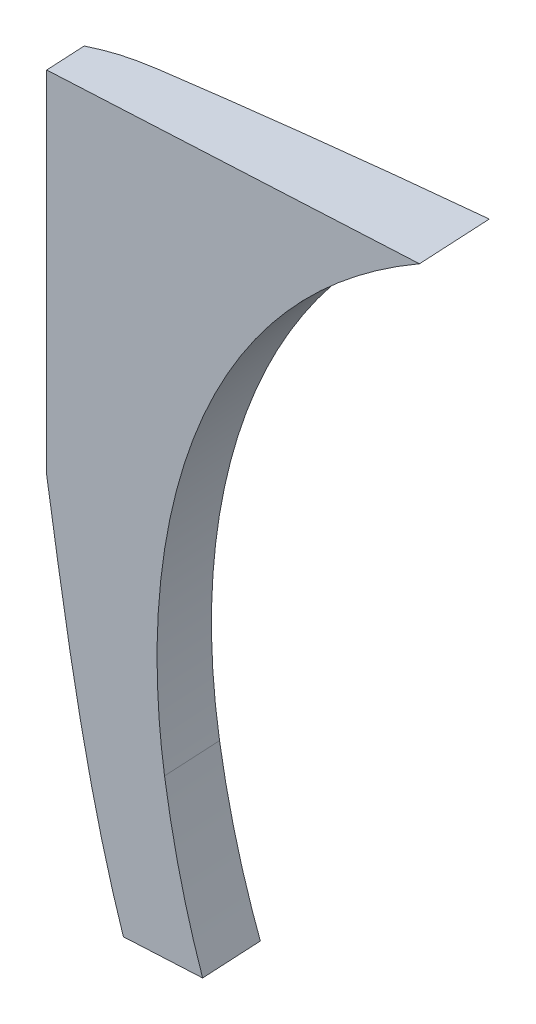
ISO-10303-21;
HEADER;
FILE_DESCRIPTION(('STEP AP214'),'2;1');
FILE_NAME('part.step','',(''),(''),'','','');
FILE_SCHEMA(('AUTOMOTIVE_DESIGN { 1 0 10303 214 1 1 1 1 }'));
ENDSEC;
DATA;
#1=APPLICATION_CONTEXT('core data for automotive mechanical design processes');
#2=APPLICATION_PROTOCOL_DEFINITION('international standard','automotive_design',2000,#1);
#3=PRODUCT_CONTEXT('',#1,'mechanical');
#4=PRODUCT('Part','Part','',(#3));
#5=PRODUCT_RELATED_PRODUCT_CATEGORY('part','',(#4));
#6=PRODUCT_DEFINITION_FORMATION('','',#4);
#7=PRODUCT_DEFINITION_CONTEXT('part definition',#1,'design');
#8=PRODUCT_DEFINITION('design','',#6,#7);
#9=PRODUCT_DEFINITION_SHAPE('','',#8);
#10=(LENGTH_UNIT() NAMED_UNIT(*) SI_UNIT(.MILLI.,.METRE.));
#11=(NAMED_UNIT(*) PLANE_ANGLE_UNIT() SI_UNIT($,.RADIAN.));
#12=(NAMED_UNIT(*) SI_UNIT($,.STERADIAN.) SOLID_ANGLE_UNIT());
#13=UNCERTAINTY_MEASURE_WITH_UNIT(LENGTH_MEASURE(1.E-05),#10,'distance_accuracy_value','');
#14=(GEOMETRIC_REPRESENTATION_CONTEXT(3) GLOBAL_UNCERTAINTY_ASSIGNED_CONTEXT((#13)) GLOBAL_UNIT_ASSIGNED_CONTEXT((#10,
#11,#12)) REPRESENTATION_CONTEXT('',''));
#15=CARTESIAN_POINT('',(0.,0.,0.));
#16=DIRECTION('',(0.,0.,1.));
#17=DIRECTION('',(1.,0.,0.));
#18=AXIS2_PLACEMENT_3D('',#15,#16,#17);
#19=CARTESIAN_POINT('',(-22.9638132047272,10.4840430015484,26.067497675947));
#20=CARTESIAN_POINT('',(-25.3987663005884,11.0868637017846,26.1951081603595));
#21=CARTESIAN_POINT('',(-27.7321683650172,11.9315766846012,26.3173965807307));
#22=CARTESIAN_POINT('',(-30.4858055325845,13.3758203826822,26.4617085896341));
#23=CARTESIAN_POINT('',(-31.0283072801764,13.6842588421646,26.4901399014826));
#24=CARTESIAN_POINT('',(-32.0956233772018,14.3432788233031,26.5460755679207));
#25=CARTESIAN_POINT('',(-32.6186167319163,14.6929849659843,26.5734844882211));
#26=CARTESIAN_POINT('',(-34.1346029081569,15.7901519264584,26.6529339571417));
#27=CARTESIAN_POINT('',(-35.0826136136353,16.5904312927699,26.7026170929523));
#28=CARTESIAN_POINT('',(-36.4100054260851,17.8949975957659,26.7721827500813));
#29=CARTESIAN_POINT('',(-36.8366924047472,18.3472180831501,26.794544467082));
#30=CARTESIAN_POINT('',(-37.6583256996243,19.2866256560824,26.8376044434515));
#31=CARTESIAN_POINT('',(-38.0546745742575,19.7757380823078,26.8583762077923));
#32=CARTESIAN_POINT('',(-39.1848220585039,21.2810710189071,26.917604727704));
#33=CARTESIAN_POINT('',(-39.8569851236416,22.3298932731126,26.9528313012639));
#34=CARTESIAN_POINT('',(-41.0572252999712,24.5079300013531,27.0157332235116));
#35=CARTESIAN_POINT('',(-41.5852604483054,25.6371641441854,27.0434063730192));
#36=CARTESIAN_POINT('',(-42.2800880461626,27.3853256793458,27.0798207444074));
#37=CARTESIAN_POINT('',(-42.4951865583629,27.9766419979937,27.0910935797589));
#38=CARTESIAN_POINT('',(-42.8920536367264,29.1678234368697,27.1118925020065));
#39=CARTESIAN_POINT('',(-43.0742833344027,29.7686955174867,27.1214427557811));
#40=CARTESIAN_POINT('',(-43.2415979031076,30.3743611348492,27.1302113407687));
#41=B_SPLINE_CURVE_WITH_KNOTS('',3,(#19,#20,#21,#22,#23,#24,#25,#26,#27,#28,#29,#30,#31,#32,#33,
#34,#35,#36,#37,#38,#39,#40),.UNSPECIFIED.,.F.,.F.,(4,2,2,2,2,2,2,2,2,2,4),(0.,0.25,0.3125,
0.375,0.5,0.5625,0.625,0.75,0.875,0.9375,1.),.UNSPECIFIED.);
#42=DIRECTION('',(0.0523359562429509,0.,0.998629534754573));
#43=VECTOR('',#42,1.);
#44=SURFACE_OF_LINEAR_EXTRUSION('',#41,#43);
#45=OFFSET_SURFACE('',#44,0.5,.F.);
#46=CARTESIAN_POINT('',(-42.0996141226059,29.3546731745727,33.2266544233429));
#47=CARTESIAN_POINT('',(-42.1293313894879,29.450273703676,33.2308546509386));
#48=CARTESIAN_POINT('',(-42.1586430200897,29.5460027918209,33.2349958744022));
#49=CARTESIAN_POINT('',(-42.2164612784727,29.7377007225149,33.2431808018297));
#50=CARTESIAN_POINT('',(-42.244967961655,29.8336695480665,33.2472245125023));
#51=CARTESIAN_POINT('',(-42.3011866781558,30.0258427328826,33.2552354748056));
#52=CARTESIAN_POINT('',(-42.3288987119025,30.1220470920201,33.2592027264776));
#53=CARTESIAN_POINT('',(-42.3835386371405,30.3146876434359,33.2670831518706));
#54=CARTESIAN_POINT('',(-42.4104664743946,30.4111238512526,33.2709963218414));
#55=CARTESIAN_POINT('',(-42.4370055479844,30.5076674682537,33.2748933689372));
#56=B_SPLINE_CURVE_WITH_KNOTS('',3,(#46,#47,#48,#49,#50,#51,#52,#53,#54,#55),.UNSPECIFIED.,.F.,
.F.,(4,2,2,2,4),(0.,0.300601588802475,0.601182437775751,0.901763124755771,1.20236455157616),.UNSPECIFIED.);
#57=CARTESIAN_POINT('',(-42.0996141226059,29.3546731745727,33.2266544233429));
#58=VERTEX_POINT('',#57);
#59=CARTESIAN_POINT('',(-42.4370055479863,30.5076674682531,33.2748933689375));
#60=VERTEX_POINT('',#59);
#61=EDGE_CURVE('E221',#58,#60,#56,.T.);
#62=ORIENTED_EDGE('',*,*,#61,.F.);
#63=DIRECTION('',(0.0523359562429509,0.,0.998629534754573));
#64=VECTOR('',#63,1.);
#65=CARTESIAN_POINT('',(-42.0996141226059,29.3546731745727,33.2266544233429));
#66=LINE('',#65,#64);
#67=CARTESIAN_POINT('',(-42.0035329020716,29.3546731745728,35.0599933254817));
#68=VERTEX_POINT('',#67);
#69=EDGE_CURVE('E126',#58,#68,#66,.T.);
#70=ORIENTED_EDGE('',*,*,#69,.T.);
#71=CARTESIAN_POINT('',(-42.0035329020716,29.3546731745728,35.0599933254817));
#72=CARTESIAN_POINT('',(-42.0632174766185,29.54589946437,35.0631212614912));
#73=CARTESIAN_POINT('',(-42.121308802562,29.7375954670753,35.0661656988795));
#74=CARTESIAN_POINT('',(-42.2343049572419,30.1219268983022,35.0720875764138));
#75=CARTESIAN_POINT('',(-42.2892097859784,30.3145623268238,35.0749650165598));
#76=CARTESIAN_POINT('',(-42.3425213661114,30.5076674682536,35.0777589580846));
#77=B_SPLINE_CURVE_WITH_KNOTS('',3,(#71,#72,#73,#74,#75,#76),.UNSPECIFIED.,.F.,.F.,(4,2,4),(0.,
0.600983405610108,1.20196681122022),.UNSPECIFIED.);
#78=CARTESIAN_POINT('',(-42.3425213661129,30.5076674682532,35.0777589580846));
#79=VERTEX_POINT('',#78);
#80=EDGE_CURVE('E227',#68,#79,#77,.T.);
#81=ORIENTED_EDGE('',*,*,#80,.T.);
#82=DIRECTION('',(0.0523359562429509,0.,0.998629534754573));
#83=VECTOR('',#82,1.);
#84=CARTESIAN_POINT('',(-42.7603564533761,30.507667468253,27.1049905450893));
#85=LINE('',#84,#83);
#86=EDGE_CURVE('E169',#60,#79,#85,.T.);
#87=ORIENTED_EDGE('',*,*,#86,.F.);
#88=EDGE_LOOP('',(#62,#70,#81,#87));
#89=FACE_BOUND('',#88,.T.);
#90=ADVANCED_FACE('F40',(#89),#45,.F.);
#91=CARTESIAN_POINT('',(-43.2415979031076,30.3743611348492,27.1302113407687));
#92=CARTESIAN_POINT('',(-43.4946378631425,31.2903549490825,27.1434726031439));
#93=CARTESIAN_POINT('',(-43.7183606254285,32.2131361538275,27.1551974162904));
#94=CARTESIAN_POINT('',(-44.1230945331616,34.0682505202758,27.1764086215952));
#95=CARTESIAN_POINT('',(-44.303959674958,35.0002252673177,27.1858873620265));
#96=CARTESIAN_POINT('',(-44.8041696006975,37.8022867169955,27.2121022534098));
#97=CARTESIAN_POINT('',(-45.0811768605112,39.6793630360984,27.2266195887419));
#98=CARTESIAN_POINT('',(-45.3620261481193,41.5532072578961,27.2413382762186));
#99=B_SPLINE_CURVE_WITH_KNOTS('',3,(#91,#92,#93,#94,#95,#96,#97,#98),.UNSPECIFIED.,.F.,.F.,(4,2,
2,4),(0.,0.25,0.5,1.),.UNSPECIFIED.);
#100=DIRECTION('',(0.0523359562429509,0.,0.998629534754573));
#101=VECTOR('',#100,1.);
#102=SURFACE_OF_LINEAR_EXTRUSION('',#99,#101);
#103=OFFSET_SURFACE('',#102,0.5,.F.);
#104=CARTESIAN_POINT('',(-42.437005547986,30.5076674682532,33.2748933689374));
#105=CARTESIAN_POINT('',(-42.5125398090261,30.7824392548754,33.2859605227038));
#106=CARTESIAN_POINT('',(-42.5854266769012,31.057930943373,33.2969989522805));
#107=CARTESIAN_POINT('',(-42.726305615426,31.610137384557,33.3192683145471));
#108=CARTESIAN_POINT('',(-42.7942980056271,31.8868520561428,33.3304992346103));
#109=CARTESIAN_POINT('',(-42.9257600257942,32.4411646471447,33.35339834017));
#110=CARTESIAN_POINT('',(-42.9892322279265,32.7187619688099,33.3650662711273));
#111=CARTESIAN_POINT('',(-43.1121212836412,33.2748292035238,33.3889934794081));
#112=CARTESIAN_POINT('',(-43.1715380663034,33.5532991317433,33.4012527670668));
#113=CARTESIAN_POINT('',(-43.3442630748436,34.3896411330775,33.439090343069));
#114=CARTESIAN_POINT('',(-43.4520830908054,34.9486040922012,33.4657347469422));
#115=CARTESIAN_POINT('',(-43.6052660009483,35.7885213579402,33.5083242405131));
#116=CARTESIAN_POINT('',(-43.6549090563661,36.068780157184,33.522960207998));
#117=CARTESIAN_POINT('',(-43.7517544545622,36.629679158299,33.5529880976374));
#118=CARTESIAN_POINT('',(-43.7989568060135,36.9103193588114,33.5683800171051));
#119=CARTESIAN_POINT('',(-43.9053847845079,37.5572956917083,33.6046842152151));
#120=CARTESIAN_POINT('',(-43.9639005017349,37.9237338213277,33.6258515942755));
#121=CARTESIAN_POINT('',(-44.0784013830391,38.6569304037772,33.6694753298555));
#122=CARTESIAN_POINT('',(-44.1343865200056,39.0236888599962,33.6919317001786));
#123=CARTESIAN_POINT('',(-44.2447013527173,39.7571540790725,33.7383074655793));
#124=CARTESIAN_POINT('',(-44.2990319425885,40.1238607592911,33.7622260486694));
#125=CARTESIAN_POINT('',(-44.4069601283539,40.8572473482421,33.8118936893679));
#126=CARTESIAN_POINT('',(-44.4605577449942,41.2239272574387,33.8376426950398));
#127=CARTESIAN_POINT('',(-44.5142355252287,41.5905157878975,33.8644857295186));
#128=B_SPLINE_CURVE_WITH_KNOTS('',3,(#104,#105,#106,#107,#108,#109,#110,#111,#112,#113,#114,
#115,#116,#117,#118,#119,#120,#121,#122,#123,#124,#125,#126,#127),.UNSPECIFIED.,.F.,.F.,(4,2,2,
2,2,2,2,2,2,2,2,4),(0.,0.855513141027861,1.7109703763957,2.56593686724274,3.42091830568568,
5.13039210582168,5.98537797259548,6.84036080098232,7.9553984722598,9.07044808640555,
10.1848840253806,11.2992883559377),.UNSPECIFIED.);
#129=CARTESIAN_POINT('',(-44.5142355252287,41.5905157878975,33.8644857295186));
#130=VERTEX_POINT('',#129);
#131=EDGE_CURVE('E242',#60,#130,#128,.T.);
#132=ORIENTED_EDGE('',*,*,#131,.F.);
#133=ORIENTED_EDGE('',*,*,#86,.T.);
#134=CARTESIAN_POINT('',(-42.3425213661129,30.5076674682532,35.0777589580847));
#135=CARTESIAN_POINT('',(-42.4703675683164,30.9704705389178,35.0844590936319));
#136=CARTESIAN_POINT('',(-42.5907152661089,31.4352806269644,35.0907662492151));
#137=CARTESIAN_POINT('',(-42.8183771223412,32.3678778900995,35.1026975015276));
#138=CARTESIAN_POINT('',(-42.9256971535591,32.8356636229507,35.1083219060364));
#139=CARTESIAN_POINT('',(-43.1293617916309,33.7735154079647,35.1189955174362));
#140=CARTESIAN_POINT('',(-43.2257082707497,34.2435810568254,35.1240448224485));
#141=CARTESIAN_POINT('',(-43.4093955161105,35.185590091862,35.1336714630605));
#142=CARTESIAN_POINT('',(-43.4967339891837,35.6575339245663,35.1382486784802));
#143=CARTESIAN_POINT('',(-43.741461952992,37.0376753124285,35.1510743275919));
#144=CARTESIAN_POINT('',(-43.8893251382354,37.9475348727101,35.1588235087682));
#145=CARTESIAN_POINT('',(-44.1727813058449,39.7685514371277,35.1736788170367));
#146=CARTESIAN_POINT('',(-44.308382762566,40.6797070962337,35.180785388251));
#147=CARTESIAN_POINT('',(-44.4448762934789,41.5905157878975,35.1879387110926));
#148=B_SPLINE_CURVE_WITH_KNOTS('',3,(#134,#135,#136,#137,#138,#139,#140,#141,#142,#143,#144,
#145,#146,#147),.UNSPECIFIED.,.F.,.F.,(4,2,2,2,2,2,4),(0.,1.44039054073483,2.88012933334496,
4.31962211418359,5.75948044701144,8.52480153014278,11.2881965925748),.UNSPECIFIED.);
#149=CARTESIAN_POINT('',(-44.4448762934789,41.5905157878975,35.1879387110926));
#150=VERTEX_POINT('',#149);
#151=EDGE_CURVE('E234',#79,#150,#148,.T.);
#152=ORIENTED_EDGE('',*,*,#151,.T.);
#153=DIRECTION('',(0.0523359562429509,0.,0.998629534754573));
#154=VECTOR('',#153,1.);
#155=CARTESIAN_POINT('',(-44.5142355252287,41.5905157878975,33.8644857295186));
#156=LINE('',#155,#154);
#157=EDGE_CURVE('E166',#130,#150,#156,.T.);
#158=ORIENTED_EDGE('',*,*,#157,.F.);
#159=EDGE_LOOP('',(#132,#133,#152,#158));
#160=FACE_BOUND('',#159,.T.);
#161=ADVANCED_FACE('F217',(#160),#103,.F.);
#162=CARTESIAN_POINT('',(-44.862711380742,41.5532072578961,27.2151702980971));
#163=DIRECTION('',(0.998629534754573,0.,-0.0523359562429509));
#164=DIRECTION('',(-0.0523359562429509,0.,-0.998629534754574));
#165=AXIS2_PLACEMENT_3D('',#162,#163,#164);
#166=PLANE('',#165);
#167=DIRECTION('',(0.,-1.,0.));
#168=VECTOR('',#167,1.);
#169=CARTESIAN_POINT('',(-44.5142355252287,41.5905157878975,33.8644857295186));
#170=LINE('',#169,#168);
#171=CARTESIAN_POINT('',(-44.5142355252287,53.3546731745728,33.8644857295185));
#172=VERTEX_POINT('',#171);
#173=EDGE_CURVE('E65',#130,#172,#170,.F.);
#174=ORIENTED_EDGE('',*,*,#173,.F.);
#175=ORIENTED_EDGE('',*,*,#157,.T.);
#176=DIRECTION('',(0.,1.,0.));
#177=VECTOR('',#176,1.);
#178=CARTESIAN_POINT('',(-44.4448762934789,17.460142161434,35.1879387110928));
#179=LINE('',#178,#177);
#180=CARTESIAN_POINT('',(-44.4448762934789,53.3546731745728,35.1879387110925));
#181=VERTEX_POINT('',#180);
#182=EDGE_CURVE('E117',#150,#181,#179,.T.);
#183=ORIENTED_EDGE('',*,*,#182,.T.);
#184=DIRECTION('',(0.0523359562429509,0.,0.998629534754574));
#185=VECTOR('',#184,1.);
#186=CARTESIAN_POINT('',(-44.862711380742,53.3546731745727,27.215170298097));
#187=LINE('',#186,#185);
#188=EDGE_CURVE('E108',#172,#181,#187,.T.);
#189=ORIENTED_EDGE('',*,*,#188,.F.);
#190=EDGE_LOOP('',(#174,#175,#183,#189));
#191=FACE_BOUND('',#190,.T.);
#192=ADVANCED_FACE('F42',(#191),#166,.F.);
#193=CARTESIAN_POINT('',(-45.3620261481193,53.3546731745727,27.2413382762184));
#194=DIRECTION('',(0.,-1.,0.));
#195=DIRECTION('',(0.,0.,-1.));
#196=AXIS2_PLACEMENT_3D('',#193,#194,#195);
#197=PLANE('',#196);
#198=CARTESIAN_POINT('',(-44.5142355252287,53.3546731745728,33.8644857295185));
#199=CARTESIAN_POINT('',(-44.4465008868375,53.3546731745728,33.8305774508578));
#200=CARTESIAN_POINT('',(-44.3780577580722,53.3546731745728,33.7980804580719));
#201=CARTESIAN_POINT('',(-44.2402362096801,53.3546731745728,33.7361654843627));
#202=CARTESIAN_POINT('',(-44.1708648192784,53.3546731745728,33.706731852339));
#203=CARTESIAN_POINT('',(-44.0311780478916,53.3546731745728,33.6509294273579));
#204=CARTESIAN_POINT('',(-43.9608667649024,53.3546731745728,33.6245503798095));
#205=CARTESIAN_POINT('',(-43.8192963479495,53.3546731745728,33.5748304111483));
#206=CARTESIAN_POINT('',(-43.7480387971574,53.3546731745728,33.5514849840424));
#207=CARTESIAN_POINT('',(-43.6047468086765,53.3546731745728,33.5079170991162));
#208=CARTESIAN_POINT('',(-43.532714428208,53.3546731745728,33.4876878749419));
#209=CARTESIAN_POINT('',(-43.3878374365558,53.3546731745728,33.4501413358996));
#210=CARTESIAN_POINT('',(-43.3149922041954,53.3546731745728,33.4328264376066));
#211=CARTESIAN_POINT('',(-43.1687059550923,53.3546731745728,33.4005080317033));
#212=CARTESIAN_POINT('',(-43.0952643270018,53.3546731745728,33.3855073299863));
#213=CARTESIAN_POINT('',(-42.9479667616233,53.3546731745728,33.3573371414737));
#214=CARTESIAN_POINT('',(-42.8741105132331,53.3546731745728,33.3441692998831));
#215=CARTESIAN_POINT('',(-42.6839453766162,53.3546731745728,33.3120569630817));
#216=CARTESIAN_POINT('',(-42.5674709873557,53.3546731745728,33.2941061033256));
#217=CARTESIAN_POINT('',(-42.3925898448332,53.3546731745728,33.2683483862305));
#218=CARTESIAN_POINT('',(-42.3342647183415,53.3546731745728,33.2599568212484));
#219=CARTESIAN_POINT('',(-42.2175941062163,53.3546731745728,33.2433160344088));
#220=CARTESIAN_POINT('',(-42.1592486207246,53.3546731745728,33.2350668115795));
#221=CARTESIAN_POINT('',(-41.9842477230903,53.3546731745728,33.2103806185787));
#222=CARTESIAN_POINT('',(-41.8675846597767,53.3546731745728,33.1939989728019));
#223=CARTESIAN_POINT('',(-41.6342347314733,53.3546731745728,33.161444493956));
#224=CARTESIAN_POINT('',(-41.5175478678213,53.3546731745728,33.1452716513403));
#225=CARTESIAN_POINT('',(-41.2841661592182,53.3546731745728,33.1131183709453));
#226=CARTESIAN_POINT('',(-41.1674713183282,53.3546731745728,33.0971379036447));
#227=CARTESIAN_POINT('',(-40.934054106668,53.3546731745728,33.0653680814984));
#228=CARTESIAN_POINT('',(-40.8173317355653,53.3546731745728,33.0495787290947));
#229=CARTESIAN_POINT('',(-40.4671476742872,53.3546731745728,33.0024930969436));
#230=CARTESIAN_POINT('',(-40.2336483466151,53.3546731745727,32.9714763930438));
#231=CARTESIAN_POINT('',(-39.7665559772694,53.3546731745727,32.910144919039));
#232=CARTESIAN_POINT('',(-39.5329629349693,53.3546731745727,32.879830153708));
#233=CARTESIAN_POINT('',(-39.0641147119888,53.3546731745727,32.8197042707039));
#234=CARTESIAN_POINT('',(-38.828858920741,53.3546731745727,32.7898979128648));
#235=CARTESIAN_POINT('',(-38.358261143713,53.3546731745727,32.731001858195));
#236=CARTESIAN_POINT('',(-38.1229191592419,53.3546731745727,32.7019121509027));
#237=CARTESIAN_POINT('',(-37.6521501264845,53.3546731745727,32.6444492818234));
#238=CARTESIAN_POINT('',(-37.4167230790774,53.3546731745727,32.6160761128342));
#239=CARTESIAN_POINT('',(-36.9457852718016,53.3546731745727,32.5600445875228));
#240=CARTESIAN_POINT('',(-36.7102745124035,53.3546731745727,32.532386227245));
#241=CARTESIAN_POINT('',(-36.2391707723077,53.3546731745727,32.4777809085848));
#242=CARTESIAN_POINT('',(-36.0035777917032,53.3546731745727,32.4508339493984));
#243=CARTESIAN_POINT('',(-35.6400567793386,53.3546731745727,32.4098064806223));
#244=CARTESIAN_POINT('',(-35.5121568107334,53.3546731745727,32.3954768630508));
#245=CARTESIAN_POINT('',(-35.2563323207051,53.3546731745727,32.3670244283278));
#246=CARTESIAN_POINT('',(-35.1284077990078,53.3546731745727,32.3529016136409));
#247=CARTESIAN_POINT('',(-34.8725351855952,53.3546731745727,32.3248616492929));
#248=CARTESIAN_POINT('',(-34.7445870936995,53.3546731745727,32.3109445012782));
#249=CARTESIAN_POINT('',(-34.4886683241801,53.3546731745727,32.283314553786));
#250=CARTESIAN_POINT('',(-34.360697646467,53.3546731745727,32.2696017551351));
#251=CARTESIAN_POINT('',(-34.1053171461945,53.3546731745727,32.2424409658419));
#252=CARTESIAN_POINT('',(-33.977907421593,53.3546731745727,32.228992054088));
#253=CARTESIAN_POINT('',(-33.7230678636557,53.3546731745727,32.2022936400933));
#254=CARTESIAN_POINT('',(-33.5956380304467,53.3546731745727,32.1890441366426));
#255=CARTESIAN_POINT('',(-33.3407595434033,53.3546731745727,32.1627427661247));
#256=CARTESIAN_POINT('',(-33.2133108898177,53.3546731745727,32.1496908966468));
#257=CARTESIAN_POINT('',(-32.9583960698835,53.3546731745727,32.1237828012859));
#258=CARTESIAN_POINT('',(-32.8309299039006,53.3546731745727,32.1109265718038));
#259=CARTESIAN_POINT('',(-32.7034540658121,53.3546731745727,32.0981670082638));
#260=B_SPLINE_CURVE_WITH_KNOTS('',3,(#198,#199,#200,#201,#202,#203,#204,#205,#206,#207,#208,
#209,#210,#211,#212,#213,#214,#215,#216,#217,#218,#219,#220,#221,#222,#223,#224,#225,#226,#227,
#228,#229,#230,#231,#232,#233,#234,#235,#236,#237,#238,#239,#240,#241,#242,#243,#244,#245,#246,
#247,#248,#249,#250,#251,#252,#253,#254,#255,#256,#257,#258,#259),.UNSPECIFIED.,.F.,.F.,(4,2,2,
2,2,2,2,2,2,2,2,2,2,2,2,2,2,2,2,2,2,2,2,2,2,2,2,2,2,2,4),(0.,0.227230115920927,
0.453235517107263,0.678458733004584,0.903343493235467,1.12773285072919,1.35230736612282,
1.57715206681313,1.80219730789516,2.15571539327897,2.33249351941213,2.50927043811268,
2.8626933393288,3.21610002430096,3.56945176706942,3.92280802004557,4.62945787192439,
5.33611252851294,6.04752083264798,6.75891874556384,7.47030950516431,8.18169632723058,
8.8930823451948,9.2791827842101,9.66528782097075,10.0513959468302,10.4375056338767,
10.8218581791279,11.2062083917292,11.5905539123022,11.9748923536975),.UNSPECIFIED.);
#261=CARTESIAN_POINT('',(-32.7034540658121,53.3546731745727,32.0981670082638));
#262=VERTEX_POINT('',#261);
#263=EDGE_CURVE('E176',#172,#262,#260,.T.);
#264=ORIENTED_EDGE('',*,*,#263,.F.);
#265=ORIENTED_EDGE('',*,*,#188,.T.);
#266=DIRECTION('',(0.998629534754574,0.,-0.0523359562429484));
#267=VECTOR('',#266,1.);
#268=CARTESIAN_POINT('',(-35.5497064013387,53.3546731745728,34.7217626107));
#269=LINE('',#268,#267);
#270=CARTESIAN_POINT('',(-32.574129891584,53.3546731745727,34.565819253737));
#271=VERTEX_POINT('',#270);
#272=EDGE_CURVE('E111',#181,#271,#269,.T.);
#273=ORIENTED_EDGE('',*,*,#272,.T.);
#274=DIRECTION('',(0.0523359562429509,0.,0.998629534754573));
#275=VECTOR('',#274,1.);
#276=CARTESIAN_POINT('',(-32.7034540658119,53.3546731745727,32.0981670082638));
#277=LINE('',#276,#275);
#278=EDGE_CURVE('E100',#262,#271,#277,.T.);
#279=ORIENTED_EDGE('',*,*,#278,.F.);
#280=EDGE_LOOP('',(#264,#265,#273,#279));
#281=FACE_BOUND('',#280,.T.);
#282=ADVANCED_FACE('F112',(#281),#197,.F.);
#283=CARTESIAN_POINT('',(-42.7863839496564,29.3546731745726,27.1063545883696));
#284=DIRECTION('',(0.,1.,0.));
#285=DIRECTION('',(0.,0.,1.));
#286=AXIS2_PLACEMENT_3D('',#283,#284,#285);
#287=PLANE('',#286);
#288=CARTESIAN_POINT('',(-39.5868555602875,29.3546731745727,32.8869222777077));
#289=CARTESIAN_POINT('',(-39.7964089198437,29.3546731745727,32.9140635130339));
#290=CARTESIAN_POINT('',(-40.0059268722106,29.3546731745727,32.9414788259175));
#291=CARTESIAN_POINT('',(-40.4248846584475,29.3546731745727,32.9968866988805));
#292=CARTESIAN_POINT('',(-40.634324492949,29.3546731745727,33.0248792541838));
#293=CARTESIAN_POINT('',(-41.0531222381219,29.3546731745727,33.0814711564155));
#294=CARTESIAN_POINT('',(-41.2624801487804,29.3546731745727,33.110070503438));
#295=CARTESIAN_POINT('',(-41.6811117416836,29.3546731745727,33.1678917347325));
#296=CARTESIAN_POINT('',(-41.8903854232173,29.3546731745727,33.1971136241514));
#297=CARTESIAN_POINT('',(-42.0996141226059,29.3546731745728,33.2266544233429));
#298=B_SPLINE_CURVE_WITH_KNOTS('',3,(#288,#289,#290,#291,#292,#293,#294,#295,#296,#297),
.UNSPECIFIED.,.F.,.F.,(4,2,2,2,4),(0.,0.633911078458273,1.26781691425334,1.90172284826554,
2.53563402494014),.UNSPECIFIED.);
#299=CARTESIAN_POINT('',(-39.5868555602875,29.3546731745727,32.8869222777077));
#300=VERTEX_POINT('',#299);
#301=EDGE_CURVE('E12',#300,#58,#298,.T.);
#302=ORIENTED_EDGE('',*,*,#301,.F.);
#303=DIRECTION('',(0.0523359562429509,0.,0.998629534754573));
#304=VECTOR('',#303,1.);
#305=CARTESIAN_POINT('',(-39.5868555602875,29.3546731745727,32.8869222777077));
#306=LINE('',#305,#304);
#307=CARTESIAN_POINT('',(-39.4799010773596,29.3546731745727,34.9277353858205));
#308=VERTEX_POINT('',#307);
#309=EDGE_CURVE('E173',#300,#308,#306,.T.);
#310=ORIENTED_EDGE('',*,*,#309,.T.);
#311=DIRECTION('',(-0.998629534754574,0.,0.0523359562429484));
#312=VECTOR('',#311,1.);
#313=CARTESIAN_POINT('',(-35.5497064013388,29.3546731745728,34.7217626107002));
#314=LINE('',#313,#312);
#315=EDGE_CURVE('E123',#308,#68,#314,.T.);
#316=ORIENTED_EDGE('',*,*,#315,.T.);
#317=ORIENTED_EDGE('',*,*,#69,.F.);
#318=EDGE_LOOP('',(#302,#310,#316,#317));
#319=FACE_BOUND('',#318,.T.);
#320=ADVANCED_FACE('F144',(#319),#287,.F.);
#321=CARTESIAN_POINT('',(-27.0419476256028,54.946803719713,26.2812236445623));
#322=CARTESIAN_POINT('',(-28.1620679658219,54.7224976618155,26.3399266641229));
#323=CARTESIAN_POINT('',(-29.2595819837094,54.4215453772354,26.3974449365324));
#324=CARTESIAN_POINT('',(-30.863241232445,53.8254842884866,26.4814891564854));
#325=CARTESIAN_POINT('',(-31.3900614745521,53.6024938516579,26.5090986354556));
#326=CARTESIAN_POINT('',(-32.4118373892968,53.1099232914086,26.5626476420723));
#327=CARTESIAN_POINT('',(-32.9087386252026,52.839676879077,26.5886891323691));
#328=CARTESIAN_POINT('',(-33.8723987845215,52.2474975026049,26.6391924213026));
#329=CARTESIAN_POINT('',(-34.3391627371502,51.9255731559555,26.6636544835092));
#330=CARTESIAN_POINT('',(-35.0147096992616,51.4004626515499,26.6990583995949));
#331=CARTESIAN_POINT('',(-35.2361656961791,51.2179813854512,26.7106644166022));
#332=CARTESIAN_POINT('',(-35.6648901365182,50.8434027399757,26.7331329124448));
#333=CARTESIAN_POINT('',(-35.8728576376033,50.6508035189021,26.7440320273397));
#334=CARTESIAN_POINT('',(-36.8811042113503,49.6615640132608,26.7968719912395));
#335=CARTESIAN_POINT('',(-37.5869424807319,48.7864672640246,26.8338634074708));
#336=CARTESIAN_POINT('',(-38.4981460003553,47.3510401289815,26.8816175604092));
#337=CARTESIAN_POINT('',(-38.7786014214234,46.8487495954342,26.8963156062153));
#338=CARTESIAN_POINT('',(-39.27910032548,45.8267082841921,26.9225456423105));
#339=CARTESIAN_POINT('',(-39.500470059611,45.3056810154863,26.9341471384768));
#340=CARTESIAN_POINT('',(-39.8904474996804,44.2453343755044,26.9545849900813));
#341=CARTESIAN_POINT('',(-40.0590458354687,43.7060117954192,26.9634208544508));
#342=CARTESIAN_POINT('',(-40.3468484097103,42.6102344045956,26.9785039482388));
#343=CARTESIAN_POINT('',(-40.4662483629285,42.0525693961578,26.9847614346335));
#344=CARTESIAN_POINT('',(-40.7520078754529,40.3626885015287,26.9997374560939));
#345=CARTESIAN_POINT('',(-40.8438572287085,39.2349388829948,27.0045510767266));
#346=CARTESIAN_POINT('',(-40.8578786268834,36.9774399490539,27.0052859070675));
#347=CARTESIAN_POINT('',(-40.7800328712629,35.8476904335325,27.0012061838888));
#348=CARTESIAN_POINT('',(-40.6167672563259,34.7169344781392,26.9926497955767));
#349=B_SPLINE_CURVE_WITH_KNOTS('',3,(#321,#322,#323,#324,#325,#326,#327,#328,#329,#330,#331,
#332,#333,#334,#335,#336,#337,#338,#339,#340,#341,#342,#343,#344,#345,#346,#347,#348),
.UNSPECIFIED.,.F.,.F.,(4,2,2,2,2,2,2,2,2,2,2,2,2,4),(0.,0.124999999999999,0.187499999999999,
0.249999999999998,0.312499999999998,0.343749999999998,0.374999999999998,0.499999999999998,
0.562499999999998,0.624999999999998,0.687499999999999,0.749999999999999,0.875,1.),.UNSPECIFIED.);
#350=DIRECTION('',(0.0523359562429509,0.,0.998629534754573));
#351=VECTOR('',#350,1.);
#352=SURFACE_OF_LINEAR_EXTRUSION('',#349,#351);
#353=OFFSET_SURFACE('',#352,0.5,.F.);
#354=CARTESIAN_POINT('',(-32.574129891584,53.3546731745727,34.565819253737));
#355=CARTESIAN_POINT('',(-32.829683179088,53.2132406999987,34.5792122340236));
#356=CARTESIAN_POINT('',(-33.0816267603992,53.0652039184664,34.5924160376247));
#357=CARTESIAN_POINT('',(-33.5774266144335,52.7558463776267,34.6183998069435));
#358=CARTESIAN_POINT('',(-33.8212784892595,52.5945185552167,34.6311795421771));
#359=CARTESIAN_POINT('',(-34.2997797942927,52.258635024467,34.656256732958));
#360=CARTESIAN_POINT('',(-34.5344281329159,52.0840777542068,34.6685541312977));
#361=CARTESIAN_POINT('',(-34.9927847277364,51.7225930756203,34.6925755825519));
#362=CARTESIAN_POINT('',(-35.2165262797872,51.5357080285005,34.7043013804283));
#363=CARTESIAN_POINT('',(-35.6529234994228,51.1494522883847,34.7271719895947));
#364=CARTESIAN_POINT('',(-35.8655811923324,50.950083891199,34.7383169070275));
#365=CARTESIAN_POINT('',(-36.2790467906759,50.5394218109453,34.7599857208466));
#366=CARTESIAN_POINT('',(-36.4798558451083,50.3281292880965,34.7705096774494));
#367=CARTESIAN_POINT('',(-36.8694783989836,49.8936273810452,34.7909289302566));
#368=CARTESIAN_POINT('',(-37.0582556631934,49.6703854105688,34.8008223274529));
#369=CARTESIAN_POINT('',(-37.4226039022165,49.2133060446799,34.8199170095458));
#370=CARTESIAN_POINT('',(-37.5981733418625,48.979467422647,34.8291182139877));
#371=CARTESIAN_POINT('',(-37.9357218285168,48.5021631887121,34.8468083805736));
#372=CARTESIAN_POINT('',(-38.0977009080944,48.2586975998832,34.8552973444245));
#373=CARTESIAN_POINT('',(-38.4076704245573,47.7631013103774,34.8715421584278));
#374=CARTESIAN_POINT('',(-38.5556655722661,47.5109735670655,34.8792982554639));
#375=CARTESIAN_POINT('',(-38.7672785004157,47.1270868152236,34.8903884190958));
#376=CARTESIAN_POINT('',(-38.8360893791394,46.9981687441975,34.8939946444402));
#377=CARTESIAN_POINT('',(-38.9701979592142,46.7385177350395,34.9010229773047));
#378=CARTESIAN_POINT('',(-39.0354958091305,46.6077848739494,34.9044450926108));
#379=CARTESIAN_POINT('',(-39.2261346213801,46.2130581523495,34.914436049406));
#380=CARTESIAN_POINT('',(-39.3462334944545,45.9465131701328,34.9207301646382));
#381=CARTESIAN_POINT('',(-39.6299329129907,45.2710328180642,34.9355982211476));
#382=CARTESIAN_POINT('',(-39.7847454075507,44.8583750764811,34.9437116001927));
#383=CARTESIAN_POINT('',(-40.0636904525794,44.0227728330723,34.9583304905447));
#384=CARTESIAN_POINT('',(-40.1878160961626,43.5998260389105,34.964835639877));
#385=CARTESIAN_POINT('',(-40.4066182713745,42.7455122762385,34.9763025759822));
#386=CARTESIAN_POINT('',(-40.5012391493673,42.3141310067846,34.9812614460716));
#387=CARTESIAN_POINT('',(-40.6216979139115,41.6631782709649,34.9875744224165));
#388=CARTESIAN_POINT('',(-40.6582735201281,41.4455349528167,34.9894912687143));
#389=CARTESIAN_POINT('',(-40.7244730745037,41.0091659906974,34.9929606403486));
#390=CARTESIAN_POINT('',(-40.7540964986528,40.7904402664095,34.994513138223));
#391=CARTESIAN_POINT('',(-40.8097200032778,40.3246948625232,34.9974282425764));
#392=CARTESIAN_POINT('',(-40.8348005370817,40.0775650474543,34.9987426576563));
#393=CARTESIAN_POINT('',(-40.8763846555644,39.5825860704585,35.0009219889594));
#394=CARTESIAN_POINT('',(-40.8928882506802,39.3347369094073,35.0017869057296));
#395=CARTESIAN_POINT('',(-40.9175172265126,38.8385857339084,35.003077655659));
#396=CARTESIAN_POINT('',(-40.9256412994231,38.5902836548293,35.003503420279));
#397=CARTESIAN_POINT('',(-40.9337863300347,38.0935476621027,35.0039302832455));
#398=CARTESIAN_POINT('',(-40.9338072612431,37.8451137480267,35.0039313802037));
#399=CARTESIAN_POINT('',(-40.9258459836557,37.3498105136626,35.0035141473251));
#400=CARTESIAN_POINT('',(-40.9179100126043,37.1029404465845,35.0030982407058));
#401=CARTESIAN_POINT('',(-40.8941161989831,36.6095846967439,35.0018512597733));
#402=CARTESIAN_POINT('',(-40.8782583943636,36.3630990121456,35.0010201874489));
#403=CARTESIAN_POINT('',(-40.8386957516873,35.8708794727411,34.9989467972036));
#404=CARTESIAN_POINT('',(-40.8149946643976,35.6251453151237,34.9977046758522));
#405=CARTESIAN_POINT('',(-40.7598408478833,35.1345503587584,34.9948141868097));
#406=CARTESIAN_POINT('',(-40.7283881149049,34.8896895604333,34.9931658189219));
#407=CARTESIAN_POINT('',(-40.6931082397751,34.6453854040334,34.991316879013));
#408=B_SPLINE_CURVE_WITH_KNOTS('',3,(#354,#355,#356,#357,#358,#359,#360,#361,#362,#363,#364,
#365,#366,#367,#368,#369,#370,#371,#372,#373,#374,#375,#376,#377,#378,#379,#380,#381,#382,#383,
#384,#385,#386,#387,#388,#389,#390,#391,#392,#393,#394,#395,#396,#397,#398,#399,#400,#401,#402,
#403,#404,#405,#406,#407),.UNSPECIFIED.,.F.,.F.,(4,2,2,2,2,2,2,2,2,2,2,2,2,2,2,2,2,2,2,2,2,2,2,
2,2,2,4),(0.,0.877109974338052,1.75468910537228,2.63237200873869,3.50718200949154,
4.38183159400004,5.25639622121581,6.13348108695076,7.010667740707,7.88785229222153,
8.76474028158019,9.20322841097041,9.64169798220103,10.5185585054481,11.8396746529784,
13.1610878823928,14.4849787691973,15.1469981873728,15.8090674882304,16.5541211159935,
17.299173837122,18.0443428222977,18.7895142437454,19.5303804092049,20.2712430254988,
21.0117518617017,21.7522610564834),.UNSPECIFIED.);
#409=CARTESIAN_POINT('',(-40.6931082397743,34.6453854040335,34.9913168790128));
#410=VERTEX_POINT('',#409);
#411=EDGE_CURVE('E44',#271,#410,#408,.T.);
#412=ORIENTED_EDGE('',*,*,#411,.T.);
#413=DIRECTION('',(0.0523359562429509,0.,0.998629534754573));
#414=VECTOR('',#413,1.);
#415=CARTESIAN_POINT('',(-41.1109433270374,34.6453854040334,27.0185484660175));
#416=LINE('',#415,#414);
#417=CARTESIAN_POINT('',(-40.7950265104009,34.6453854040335,33.046600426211));
#418=VERTEX_POINT('',#417);
#419=EDGE_CURVE('E94',#418,#410,#416,.T.);
#420=ORIENTED_EDGE('',*,*,#419,.F.);
#421=CARTESIAN_POINT('',(-40.5933621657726,33.2426974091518,33.0194903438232));
#422=CARTESIAN_POINT('',(-40.6092116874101,33.352940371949,33.0216136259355));
#423=CARTESIAN_POINT('',(-40.6250618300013,33.463183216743,33.0237387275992));
#424=CARTESIAN_POINT('',(-40.6567615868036,33.6836664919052,33.0279923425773));
#425=CARTESIAN_POINT('',(-40.6726112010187,33.7939069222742,33.0301208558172));
#426=CARTESIAN_POINT('',(-40.7043231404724,34.0144875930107,33.0343830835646));
#427=CARTESIAN_POINT('',(-40.7201854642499,34.1248278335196,33.0365168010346));
#428=CARTESIAN_POINT('',(-40.7439832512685,34.2903386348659,33.0397205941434));
#429=CARTESIAN_POINT('',(-40.7519166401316,34.3455095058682,33.0407890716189));
#430=CARTESIAN_POINT('',(-40.7677755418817,34.4558525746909,33.0429258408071));
#431=CARTESIAN_POINT('',(-40.7757010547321,34.5110247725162,33.0439941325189));
#432=CARTESIAN_POINT('',(-40.7915833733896,34.6213741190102,33.0461358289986));
#433=CARTESIAN_POINT('',(-40.7995401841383,34.6765512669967,33.0472092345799));
#434=CARTESIAN_POINT('',(-40.8150247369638,34.7869666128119,33.0492989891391));
#435=CARTESIAN_POINT('',(-40.822552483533,34.8422048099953,33.0503153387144));
#436=CARTESIAN_POINT('',(-40.8372285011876,34.9527301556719,33.0522975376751));
#437=CARTESIAN_POINT('',(-40.8443767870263,35.0080173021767,33.0532633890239));
#438=CARTESIAN_POINT('',(-40.8582792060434,35.1186425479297,33.0551424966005));
#439=CARTESIAN_POINT('',(-40.8650333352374,35.1739806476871,33.0560557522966));
#440=CARTESIAN_POINT('',(-40.8847409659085,35.3403492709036,33.0587213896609));
#441=CARTESIAN_POINT('',(-40.8971022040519,35.4514518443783,33.0603945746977));
#442=CARTESIAN_POINT('',(-40.9202356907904,35.6738292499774,33.0635276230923));
#443=CARTESIAN_POINT('',(-40.9310078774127,35.785104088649,33.0649874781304));
#444=CARTESIAN_POINT('',(-40.9509514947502,36.0077629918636,33.0676915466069));
#445=CARTESIAN_POINT('',(-40.9601234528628,36.1191470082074,33.0689358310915));
#446=CARTESIAN_POINT('',(-40.9768634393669,36.342034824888,33.071207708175));
#447=CARTESIAN_POINT('',(-40.9844315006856,36.4535386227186,33.0722353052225));
#448=CARTESIAN_POINT('',(-41.0047185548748,36.7881807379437,33.0749907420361));
#449=CARTESIAN_POINT('',(-41.0150223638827,37.0114714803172,33.0763914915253));
#450=CARTESIAN_POINT('',(-41.0327191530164,37.5706195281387,33.078797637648));
#451=CARTESIAN_POINT('',(-41.0360424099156,37.9066148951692,33.0792499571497));
#452=CARTESIAN_POINT('',(-41.0279846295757,38.5784933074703,33.0781539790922));
#453=CARTESIAN_POINT('',(-41.0166006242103,38.9143763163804,33.0766052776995));
#454=CARTESIAN_POINT('',(-40.9784940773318,39.5848710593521,33.0714283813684));
#455=CARTESIAN_POINT('',(-40.9517895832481,39.9194838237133,33.067802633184));
#456=CARTESIAN_POINT('',(-40.8826059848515,40.5869846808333,33.0584300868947));
#457=CARTESIAN_POINT('',(-40.8401299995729,40.9198731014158,33.0526837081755));
#458=CARTESIAN_POINT('',(-40.7416682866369,41.5665362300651,33.039403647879));
#459=CARTESIAN_POINT('',(-40.6864668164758,41.8804323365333,33.0319740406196));
#460=CARTESIAN_POINT('',(-40.5610641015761,42.5051455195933,33.0151568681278));
#461=CARTESIAN_POINT('',(-40.4908641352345,42.8159628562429,33.0057694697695));
#462=CARTESIAN_POINT('',(-40.3350871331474,43.4334940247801,32.9850292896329));
#463=CARTESIAN_POINT('',(-40.2495180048,43.7402098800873,32.9736775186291));
#464=CARTESIAN_POINT('',(-40.0625566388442,44.3486954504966,32.9490003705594));
#465=CARTESIAN_POINT('',(-39.961165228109,44.6504654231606,32.9356750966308));
#466=CARTESIAN_POINT('',(-39.7453960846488,45.2394295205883,32.9074835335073));
#467=CARTESIAN_POINT('',(-39.631475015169,45.5267933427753,32.8926725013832));
#468=CARTESIAN_POINT('',(-39.3881466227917,46.0948644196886,32.8612435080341));
#469=CARTESIAN_POINT('',(-39.2587362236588,46.3755703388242,32.8446251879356));
#470=CARTESIAN_POINT('',(-38.9842255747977,46.9291505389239,32.8096352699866));
#471=CARTESIAN_POINT('',(-38.8391239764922,47.2020241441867,32.7912635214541));
#472=CARTESIAN_POINT('',(-38.6099105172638,47.6047233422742,32.7624839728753));
#473=CARTESIAN_POINT('',(-38.5315523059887,47.7378960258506,32.7526838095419));
#474=CARTESIAN_POINT('',(-38.3709322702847,48.0018352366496,32.7326820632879));
#475=CARTESIAN_POINT('',(-38.2886704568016,48.1326017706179,32.722480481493));
#476=CARTESIAN_POINT('',(-38.0361323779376,48.5210913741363,32.6913050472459));
#477=CARTESIAN_POINT('',(-37.8600784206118,48.7750485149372,32.6697573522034));
#478=CARTESIAN_POINT('',(-37.4929660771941,49.2716699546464,32.6252856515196));
#479=CARTESIAN_POINT('',(-37.301910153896,49.5143360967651,32.6023618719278));
#480=CARTESIAN_POINT('',(-36.9109113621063,49.9807291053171,32.5559736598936));
#481=CARTESIAN_POINT('',(-36.7113716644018,50.2047972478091,32.5325427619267));
#482=CARTESIAN_POINT('',(-36.2993242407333,50.6406073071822,32.4847279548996));
#483=CARTESIAN_POINT('',(-36.0868152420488,50.8523480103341,32.460343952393));
#484=CARTESIAN_POINT('',(-35.649606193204,51.2628231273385,32.4108116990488));
#485=CARTESIAN_POINT('',(-35.4249040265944,51.4615552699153,32.385663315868));
#486=CARTESIAN_POINT('',(-34.9634248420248,51.8462366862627,32.3347111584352));
#487=CARTESIAN_POINT('',(-34.7266050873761,52.0321343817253,32.3089052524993));
#488=CARTESIAN_POINT('',(-34.2427133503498,52.3899419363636,32.256931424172));
#489=CARTESIAN_POINT('',(-33.9956423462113,52.5618531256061,32.2307635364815));
#490=CARTESIAN_POINT('',(-33.4924270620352,52.8915480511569,32.1782637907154));
#491=CARTESIAN_POINT('',(-33.236287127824,53.0493384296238,32.1519320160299));
#492=CARTESIAN_POINT('',(-32.9760951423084,53.2000700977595,32.1256060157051));
#493=B_SPLINE_CURVE_WITH_KNOTS('',3,(#421,#422,#423,#424,#425,#426,#427,#428,#429,#430,#431,
#432,#433,#434,#435,#436,#437,#438,#439,#440,#441,#442,#443,#444,#445,#446,#447,#448,#449,#450,
#451,#452,#453,#454,#455,#456,#457,#458,#459,#460,#461,#462,#463,#464,#465,#466,#467,#468,#469,
#470,#471,#472,#473,#474,#475,#476,#477,#478,#479,#480,#481,#482,#483,#484,#485,#486,#487,#488,
#489,#490,#491,#492),.UNSPECIFIED.,.F.,.F.,(4,2,2,2,2,2,2,2,2,2,2,2,2,2,2,2,2,2,2,2,2,2,2,2,2,2,
2,2,2,2,2,2,2,2,2,4),(0.,0.334190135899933,0.668373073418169,1.00285810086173,1.17010383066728,
1.33735033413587,1.50462439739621,1.67189670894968,1.83916251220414,2.00643000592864,
2.34181931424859,2.67722169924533,3.01251333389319,3.34779808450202,4.01830223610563,
5.02600027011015,6.03390170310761,7.04061826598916,8.04713584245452,9.00318132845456,
9.95914535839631,10.9146189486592,11.8700426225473,12.7980232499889,13.7261884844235,
14.6544335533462,15.1188529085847,15.5832709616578,16.5119549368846,17.4404867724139,
18.3428045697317,19.2452110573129,20.1477746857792,21.0537764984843,21.9596920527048,
22.8651792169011),.UNSPECIFIED.);
#494=CARTESIAN_POINT('',(-33.3610483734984,52.970040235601,32.1648598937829));
#495=VERTEX_POINT('',#494);
#496=EDGE_CURVE('E182',#495,#418,#493,.F.);
#497=ORIENTED_EDGE('',*,*,#496,.F.);
#498=CARTESIAN_POINT('',(-36.1727788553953,50.76350570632,32.4702826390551));
#499=CARTESIAN_POINT('',(-36.0705478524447,50.8650191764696,32.4585664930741));
#500=CARTESIAN_POINT('',(-35.9668707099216,50.965064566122,32.4467523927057));
#501=CARTESIAN_POINT('',(-35.7571080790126,51.1617822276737,32.4229937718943));
#502=CARTESIAN_POINT('',(-35.6510329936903,51.2584656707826,32.4110499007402));
#503=CARTESIAN_POINT('',(-35.4365094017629,51.4485015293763,32.3870447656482));
#504=CARTESIAN_POINT('',(-35.3280687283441,51.5418628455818,32.3749839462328));
#505=CARTESIAN_POINT('',(-35.108873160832,51.7253264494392,32.3507603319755));
#506=CARTESIAN_POINT('',(-34.998123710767,51.8154352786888,32.3385978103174));
#507=CARTESIAN_POINT('',(-34.7743337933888,51.9924227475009,32.314182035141));
#508=CARTESIAN_POINT('',(-34.6612967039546,52.0793056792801,32.3019289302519));
#509=CARTESIAN_POINT('',(-34.4329745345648,52.249894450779,32.2773451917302));
#510=CARTESIAN_POINT('',(-34.3176909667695,52.333602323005,32.2650146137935));
#511=CARTESIAN_POINT('',(-34.0849465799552,52.4978519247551,32.2402917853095));
#512=CARTESIAN_POINT('',(-33.9674863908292,52.5783945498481,32.2278995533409));
#513=CARTESIAN_POINT('',(-33.7303772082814,52.7363911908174,32.2030601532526));
#514=CARTESIAN_POINT('',(-33.610726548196,52.8138426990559,32.1906129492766));
#515=CARTESIAN_POINT('',(-33.3692642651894,52.9657056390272,32.1656743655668));
#516=CARTESIAN_POINT('',(-33.2474496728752,53.0401123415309,32.1531829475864));
#517=CARTESIAN_POINT('',(-33.0016811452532,53.1859243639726,32.1281657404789));
#518=CARTESIAN_POINT('',(-32.8777231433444,53.2573228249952,32.1156399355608));
#519=CARTESIAN_POINT('',(-32.6276876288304,53.3971530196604,32.0905633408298));
#520=CARTESIAN_POINT('',(-32.5016051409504,53.4655758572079,32.078012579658));
#521=CARTESIAN_POINT('',(-32.2473409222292,53.5994935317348,32.0528949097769));
#522=CARTESIAN_POINT('',(-32.1191534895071,53.6649775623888,32.040328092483));
#523=CARTESIAN_POINT('',(-31.9901848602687,53.728884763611,32.0277830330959));
#524=B_SPLINE_CURVE_WITH_KNOTS('',3,(#498,#499,#500,#501,#502,#503,#504,#505,#506,#507,#508,
#509,#510,#511,#512,#513,#514,#515,#516,#517,#518,#519,#520,#521,#522,#523),.UNSPECIFIED.,.F.,
.F.,(4,2,2,2,2,2,2,2,2,2,2,2,4),(0.,0.433621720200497,0.865629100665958,1.29637525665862,
1.72620039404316,2.15543148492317,2.5843830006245,3.01321226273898,3.44238261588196,
3.87219604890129,4.30294160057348,4.73489701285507,5.16832872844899),.UNSPECIFIED.);
#525=EDGE_CURVE('E56',#495,#262,#524,.T.);
#526=ORIENTED_EDGE('',*,*,#525,.T.);
#527=ORIENTED_EDGE('',*,*,#278,.T.);
#528=EDGE_LOOP('',(#412,#420,#497,#526,#527));
#529=FACE_BOUND('',#528,.T.);
#530=ADVANCED_FACE('F102',(#529),#353,.F.);
#531=CARTESIAN_POINT('',(-40.6167672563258,34.7169344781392,26.9926497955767));
#532=CARTESIAN_POINT('',(-40.3982239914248,33.2033512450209,26.981196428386));
#533=CARTESIAN_POINT('',(-40.0809672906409,31.7039291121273,26.9645697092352));
#534=CARTESIAN_POINT('',(-39.2233937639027,28.7958226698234,26.919626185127));
#535=CARTESIAN_POINT('',(-38.6827688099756,27.3815596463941,26.8912932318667));
#536=CARTESIAN_POINT('',(-37.6747633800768,25.3301836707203,26.8384659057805));
#537=CARTESIAN_POINT('',(-37.3047394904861,24.6570710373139,26.8190737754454));
#538=CARTESIAN_POINT('',(-36.5108178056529,23.3623262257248,26.7774661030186));
#539=CARTESIAN_POINT('',(-36.0854278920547,22.7372738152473,26.7551723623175));
#540=CARTESIAN_POINT('',(-34.7245657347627,20.928550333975,26.6838525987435));
#541=CARTESIAN_POINT('',(-33.7043837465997,19.811326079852,26.6303871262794));
#542=CARTESIAN_POINT('',(-32.5730993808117,18.7810849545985,26.5710990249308));
#543=B_SPLINE_CURVE_WITH_KNOTS('',3,(#531,#532,#533,#534,#535,#536,#537,#538,#539,#540,#541,
#542),.UNSPECIFIED.,.F.,.F.,(4,2,2,2,2,4),(0.,0.25,0.5,0.625,0.75,1.),.UNSPECIFIED.);
#544=DIRECTION('',(0.0523359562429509,0.,0.998629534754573));
#545=VECTOR('',#544,1.);
#546=SURFACE_OF_LINEAR_EXTRUSION('',#543,#545);
#547=OFFSET_SURFACE('',#546,0.5,.F.);
#548=CARTESIAN_POINT('',(-40.6931082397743,34.6453854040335,34.9913168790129));
#549=CARTESIAN_POINT('',(-40.6671756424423,34.4657856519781,34.9899578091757));
#550=CARTESIAN_POINT('',(-40.6398738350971,34.2863831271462,34.9885269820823));
#551=CARTESIAN_POINT('',(-40.5825118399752,33.9282232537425,34.9855207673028));
#552=CARTESIAN_POINT('',(-40.5524547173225,33.7494654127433,34.9839455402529));
#553=CARTESIAN_POINT('',(-40.4895323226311,33.3926035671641,34.98064791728));
#554=CARTESIAN_POINT('',(-40.4566694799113,33.2144991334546,34.9789256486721));
#555=CARTESIAN_POINT('',(-40.3880797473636,32.858954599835,34.9753310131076));
#556=CARTESIAN_POINT('',(-40.3523545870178,32.6815141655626,34.9734587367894));
#557=CARTESIAN_POINT('',(-40.2779787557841,32.3273089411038,34.9695608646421));
#558=CARTESIAN_POINT('',(-40.2393290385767,32.1505439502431,34.9675353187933));
#559=CARTESIAN_POINT('',(-40.1590310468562,31.7976775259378,34.9633270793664));
#560=CARTESIAN_POINT('',(-40.1173824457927,31.6215761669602,34.9611443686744));
#561=CARTESIAN_POINT('',(-40.0310184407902,31.2700807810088,34.9566182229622));
#562=CARTESIAN_POINT('',(-39.9863022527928,31.0946869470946,34.9542747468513));
#563=CARTESIAN_POINT('',(-39.8937254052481,30.7446279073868,34.9494229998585));
#564=CARTESIAN_POINT('',(-39.8458630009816,30.5699631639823,34.9469146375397));
#565=CARTESIAN_POINT('',(-39.7469039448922,30.221387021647,34.9417284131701));
#566=CARTESIAN_POINT('',(-39.6958044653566,30.0474764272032,34.9390504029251));
#567=CARTESIAN_POINT('',(-39.5903163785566,29.7004242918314,34.9335220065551));
#568=CARTESIAN_POINT('',(-39.5359237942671,29.5272839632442,34.9306714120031));
#569=CARTESIAN_POINT('',(-39.4799010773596,29.3546731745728,34.9277353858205));
#570=B_SPLINE_CURVE_WITH_KNOTS('',3,(#548,#549,#550,#551,#552,#553,#554,#555,#556,#557,#558,
#559,#560,#561,#562,#563,#564,#565,#566,#567,#568,#569),.UNSPECIFIED.,.F.,.F.,(4,2,2,2,2,2,2,2,
2,2,4),(0.,0.544398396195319,1.08819836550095,1.63153217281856,2.17454012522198,
2.71737176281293,3.260262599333,3.80329271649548,4.34662655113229,4.89044173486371,
5.4349273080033),.UNSPECIFIED.);
#571=EDGE_CURVE('E122',#410,#308,#570,.T.);
#572=ORIENTED_EDGE('',*,*,#571,.T.);
#573=ORIENTED_EDGE('',*,*,#309,.F.);
#574=CARTESIAN_POINT('',(-40.8120857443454,34.7640435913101,33.0489024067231));
#575=CARTESIAN_POINT('',(-40.806606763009,34.7259156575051,33.0481628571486));
#576=CARTESIAN_POINT('',(-40.8011382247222,34.6877860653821,33.0474249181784));
#577=CARTESIAN_POINT('',(-40.7901440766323,34.6115351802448,33.0459417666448));
#578=CARTESIAN_POINT('',(-40.7846184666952,34.5734138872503,33.0451965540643));
#579=CARTESIAN_POINT('',(-40.7678391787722,34.4590804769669,33.0429342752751));
#580=CARTESIAN_POINT('',(-40.756382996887,34.3828985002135,33.041390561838));
#581=CARTESIAN_POINT('',(-40.7212804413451,34.1544659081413,33.0366634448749));
#582=CARTESIAN_POINT('',(-40.6969002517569,34.0023300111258,33.033384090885));
#583=CARTESIAN_POINT('',(-40.620714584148,33.5464061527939,33.0231503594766));
#584=CARTESIAN_POINT('',(-40.5658677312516,33.2431286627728,33.0158008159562));
#585=CARTESIAN_POINT('',(-40.4478344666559,32.6382344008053,33.0000353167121));
#586=CARTESIAN_POINT('',(-40.3846481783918,32.3366176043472,32.9916193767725));
#587=CARTESIAN_POINT('',(-40.250493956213,31.7391324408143,32.9738160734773));
#588=CARTESIAN_POINT('',(-40.1796339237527,31.4432394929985,32.9644422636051));
#589=CARTESIAN_POINT('',(-40.0292038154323,30.8536991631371,32.9446212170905));
#590=CARTESIAN_POINT('',(-39.9496335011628,30.5600518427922,32.9341739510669));
#591=CARTESIAN_POINT('',(-39.7814872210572,29.9753217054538,32.912194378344));
#592=CARTESIAN_POINT('',(-39.6929094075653,29.6842394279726,32.9006618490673));
#593=CARTESIAN_POINT('',(-39.4890781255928,29.0506383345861,32.8742542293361));
#594=CARTESIAN_POINT('',(-39.3719397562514,28.7087324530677,32.859158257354));
#595=CARTESIAN_POINT('',(-39.1243297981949,28.0297616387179,32.8274598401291));
#596=CARTESIAN_POINT('',(-38.993855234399,27.6926978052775,32.8108570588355));
#597=CARTESIAN_POINT('',(-38.7193621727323,27.0242084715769,32.7761876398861));
#598=CARTESIAN_POINT('',(-38.5753438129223,26.6927829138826,32.7581210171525));
#599=CARTESIAN_POINT('',(-38.2736553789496,26.0363024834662,32.7205875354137));
#600=CARTESIAN_POINT('',(-38.1159865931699,25.7112470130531,32.7011208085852));
#601=CARTESIAN_POINT('',(-37.8675290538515,25.2258465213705,32.6707243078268));
#602=CARTESIAN_POINT('',(-37.7818301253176,25.0628475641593,32.6602859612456));
#603=CARTESIAN_POINT('',(-37.6068982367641,24.7387750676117,32.6390811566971));
#604=CARTESIAN_POINT('',(-37.5176652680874,24.5777015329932,32.628314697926));
#605=CARTESIAN_POINT('',(-37.3356591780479,24.2575662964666,32.6064651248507));
#606=CARTESIAN_POINT('',(-37.2428856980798,24.0985048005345,32.595381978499));
#607=CARTESIAN_POINT('',(-37.0537814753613,23.7825364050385,32.5729097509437));
#608=CARTESIAN_POINT('',(-36.9574507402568,23.6256295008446,32.5615206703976));
#609=CARTESIAN_POINT('',(-36.6631200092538,23.1581259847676,32.5269138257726));
#610=CARTESIAN_POINT('',(-36.4598456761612,22.8508595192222,32.5032641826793));
#611=CARTESIAN_POINT('',(-36.0394251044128,22.2456843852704,32.4549427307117));
#612=CARTESIAN_POINT('',(-35.8222678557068,21.9477834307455,32.4302701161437));
#613=CARTESIAN_POINT('',(-35.5984276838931,21.6550526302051,32.4051698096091));
#614=B_SPLINE_CURVE_WITH_KNOTS('',3,(#574,#575,#576,#577,#578,#579,#580,#581,#582,#583,#584,
#585,#586,#587,#588,#589,#590,#591,#592,#593,#594,#595,#596,#597,#598,#599,#600,#601,#602,#603,
#604,#605,#606,#607,#608,#609,#610,#611,#612,#613),.UNSPECIFIED.,.F.,.F.,(4,2,2,2,2,2,2,2,2,2,2,
2,2,2,2,2,2,2,2,4),(0.,0.115580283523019,0.231160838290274,0.462320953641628,0.924645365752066,
1.8493748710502,2.77409069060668,3.68717272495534,4.60027975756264,5.5135744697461,
6.59848970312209,7.68364749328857,8.76879422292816,9.85383864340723,10.4071523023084,
10.9604673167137,11.5138385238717,12.0672085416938,13.1743386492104,14.2823579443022),.UNSPECIFIED.);
#615=CARTESIAN_POINT('',(-39.8189963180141,30.1074777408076,32.9171021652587));
#616=VERTEX_POINT('',#615);
#617=EDGE_CURVE('E171',#616,#300,#614,.T.);
#618=ORIENTED_EDGE('',*,*,#617,.F.);
#619=CARTESIAN_POINT('',(-38.5482506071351,26.6379632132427,32.7547838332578));
#620=CARTESIAN_POINT('',(-38.6506815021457,26.8677734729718,32.767583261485));
#621=CARTESIAN_POINT('',(-38.7497955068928,27.0990761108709,32.7800364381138));
#622=CARTESIAN_POINT('',(-38.9414685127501,27.5644473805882,32.8042359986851));
#623=CARTESIAN_POINT('',(-39.0340268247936,27.7985163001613,32.8159823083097));
#624=CARTESIAN_POINT('',(-39.2126583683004,28.2691862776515,32.8387527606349));
#625=CARTESIAN_POINT('',(-39.2987306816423,28.5057876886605,32.8497768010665));
#626=CARTESIAN_POINT('',(-39.4644839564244,28.9812826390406,32.8710929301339));
#627=CARTESIAN_POINT('',(-39.5441641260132,29.2201764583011,32.8813849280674));
#628=CARTESIAN_POINT('',(-39.6968071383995,29.6985818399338,32.901174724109));
#629=CARTESIAN_POINT('',(-39.7698067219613,29.9380815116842,32.9106768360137));
#630=CARTESIAN_POINT('',(-39.9097004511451,30.418874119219,32.928947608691));
#631=CARTESIAN_POINT('',(-39.9765948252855,30.6601669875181,32.9377162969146));
#632=CARTESIAN_POINT('',(-40.1044143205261,31.1443083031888,32.9545222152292));
#633=CARTESIAN_POINT('',(-40.1653404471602,31.3871564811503,32.9625595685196));
#634=CARTESIAN_POINT('',(-40.2813862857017,31.8741655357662,32.9779110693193));
#635=CARTESIAN_POINT('',(-40.3365080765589,32.11832590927,32.9852254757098));
#636=CARTESIAN_POINT('',(-40.4363434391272,32.5854898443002,32.9985067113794));
#637=CARTESIAN_POINT('',(-40.4815478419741,32.8083870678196,33.0045356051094));
#638=CARTESIAN_POINT('',(-40.5674222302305,33.2550622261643,33.0160126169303));
#639=CARTESIAN_POINT('',(-40.608092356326,33.4788401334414,33.0214607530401));
#640=CARTESIAN_POINT('',(-40.665786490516,33.8151107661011,33.029203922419));
#641=CARTESIAN_POINT('',(-40.6844683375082,33.9273168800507,33.0317137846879));
#642=CARTESIAN_POINT('',(-40.7207305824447,34.1519090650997,33.0365899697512));
#643=CARTESIAN_POINT('',(-40.7383109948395,34.2642951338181,33.0389562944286));
#644=CARTESIAN_POINT('',(-40.7638936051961,34.4330192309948,33.0424026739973));
#645=CARTESIAN_POINT('',(-40.7722914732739,34.4892964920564,33.043534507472));
#646=CARTESIAN_POINT('',(-40.7887814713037,34.6018966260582,33.0457578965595));
#647=CARTESIAN_POINT('',(-40.7968736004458,34.6582194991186,33.0468494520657));
#648=CARTESIAN_POINT('',(-40.8130644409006,34.7708645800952,33.0490343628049));
#649=CARTESIAN_POINT('',(-40.8211631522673,34.827186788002,33.0501277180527));
#650=CARTESIAN_POINT('',(-40.8373587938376,34.9398314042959,33.052315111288));
#651=CARTESIAN_POINT('',(-40.8454557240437,34.9961538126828,33.0534091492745));
#652=CARTESIAN_POINT('',(-40.8697487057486,35.165133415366,33.0566929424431));
#653=CARTESIAN_POINT('',(-40.8859451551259,35.2777905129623,33.0588841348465));
#654=CARTESIAN_POINT('',(-40.9183374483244,35.5031042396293,33.0632701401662));
#655=CARTESIAN_POINT('',(-40.9345332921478,35.6157608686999,33.0654649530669));
#656=CARTESIAN_POINT('',(-40.9670339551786,35.841832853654,33.0698730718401));
#657=CARTESIAN_POINT('',(-40.9833387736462,35.9552482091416,33.0720864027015));
#658=CARTESIAN_POINT('',(-41.0159482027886,36.1820790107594,33.0765168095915));
#659=CARTESIAN_POINT('',(-41.0322528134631,36.2954944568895,33.0787338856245));
#660=CARTESIAN_POINT('',(-41.0811609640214,36.6357032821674,33.0853900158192));
#661=CARTESIAN_POINT('',(-41.1137642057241,36.8624965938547,33.0898347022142));
#662=CARTESIAN_POINT('',(-41.1789573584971,37.3159960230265,33.0987374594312));
#663=CARTESIAN_POINT('',(-41.2115472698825,37.5427021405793,33.1031955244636));
#664=CARTESIAN_POINT('',(-41.2767066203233,37.9959774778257,33.1121241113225));
#665=CARTESIAN_POINT('',(-41.3092760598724,38.2225466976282,33.1165946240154));
#666=CARTESIAN_POINT('',(-41.3743873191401,38.6754985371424,33.1255471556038));
#667=CARTESIAN_POINT('',(-41.4069291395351,38.9018811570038,33.1300291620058));
#668=CARTESIAN_POINT('',(-41.4394705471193,39.1282636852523,33.1345187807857));
#669=B_SPLINE_CURVE_WITH_KNOTS('',3,(#619,#620,#621,#622,#623,#624,#625,#626,#627,#628,#629,
#630,#631,#632,#633,#634,#635,#636,#637,#638,#639,#640,#641,#642,#643,#644,#645,#646,#647,#648,
#649,#650,#651,#652,#653,#654,#655,#656,#657,#658,#659,#660,#661,#662,#663,#664,#665,#666,#667,
#668),.UNSPECIFIED.,.F.,.F.,(4,2,2,2,2,2,2,2,2,2,2,2,2,2,2,2,2,2,2,2,2,2,2,2,4),(0.,
0.755756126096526,1.51159157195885,2.26753380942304,3.02356954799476,3.77516008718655,
4.52672248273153,5.2781580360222,6.02932352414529,6.71182082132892,7.39429693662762,
7.73562768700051,8.07695395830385,8.24768818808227,8.41842287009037,8.58915896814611,
8.75989481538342,9.10140432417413,9.44291236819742,9.78672059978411,10.1305292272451,
10.8180329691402,11.5052729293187,12.1920984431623,12.8783588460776),.UNSPECIFIED.);
#670=EDGE_CURVE('E249',#616,#418,#669,.T.);
#671=ORIENTED_EDGE('',*,*,#670,.T.);
#672=ORIENTED_EDGE('',*,*,#419,.T.);
#673=EDGE_LOOP('',(#572,#573,#618,#671,#672));
#674=FACE_BOUND('',#673,.T.);
#675=ADVANCED_FACE('F137',(#674),#547,.F.);
#676=CARTESIAN_POINT('',(-35.5497064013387,17.460142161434,34.7217626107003));
#677=DIRECTION('',(0.0523359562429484,0.,0.998629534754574));
#678=DIRECTION('',(0.998629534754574,0.,-0.0523359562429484));
#679=AXIS2_PLACEMENT_3D('',#676,#677,#678);
#680=PLANE('',#679);
#681=ORIENTED_EDGE('',*,*,#80,.F.);
#682=ORIENTED_EDGE('',*,*,#315,.F.);
#683=ORIENTED_EDGE('',*,*,#571,.F.);
#684=ORIENTED_EDGE('',*,*,#411,.F.);
#685=ORIENTED_EDGE('',*,*,#272,.F.);
#686=ORIENTED_EDGE('',*,*,#182,.F.);
#687=ORIENTED_EDGE('',*,*,#151,.F.);
#688=EDGE_LOOP('',(#681,#682,#683,#684,#685,#686,#687));
#689=FACE_BOUND('',#688,.T.);
#690=ADVANCED_FACE('F120',(#689),#680,.T.);
#691=CARTESIAN_POINT('',(-47.8866802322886,71.1082166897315,37.6556414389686));
#692=CARTESIAN_POINT('',(-46.9615482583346,71.1082166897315,35.6925179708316));
#693=CARTESIAN_POINT('',(-45.2316244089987,71.1082166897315,33.6785448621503));
#694=CARTESIAN_POINT('',(-41.8819885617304,71.1082166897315,33.1933796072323));
#695=CARTESIAN_POINT('',(-34.7357233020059,71.1082166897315,32.221552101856));
#696=CARTESIAN_POINT('',(-23.0847661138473,71.1082166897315,31.197869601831));
#697=CARTESIAN_POINT('',(-5.30548712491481,71.1082166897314,30.2336497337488));
#698=CARTESIAN_POINT('',(5.04029049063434,71.1082166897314,29.6308849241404));
#699=CARTESIAN_POINT('',(10.5128213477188,71.1082166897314,29.7152749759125));
#700=CARTESIAN_POINT('',(12.6907248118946,71.1082166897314,29.8332424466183));
#701=CARTESIAN_POINT('',(13.3514375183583,71.1082166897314,29.797022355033));
#702=CARTESIAN_POINT('',(13.82638202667,71.1082166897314,29.9403771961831));
#703=CARTESIAN_POINT('',(14.2515398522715,71.1082166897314,29.7505859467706));
#704=CARTESIAN_POINT('',(14.3596746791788,71.1082166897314,29.7176550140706));
#705=B_SPLINE_CURVE_WITH_KNOTS('',3,(#691,#692,#693,#694,#695,#696,#697,#698,#699,#700,#701,
#702,#703,#704),.UNSPECIFIED.,.F.,.F.,(4,1,1,1,1,1,1,1,1,1,1,4),(0.,0.0653413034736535,
0.0793350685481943,0.10245430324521,0.296533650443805,0.508553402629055,0.714804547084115,
0.937516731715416,0.9640430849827,0.98006807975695,0.989777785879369,1.),.UNSPECIFIED.);
#706=DIRECTION('',(0.,-1.,0.));
#707=VECTOR('',#706,1.);
#708=SURFACE_OF_LINEAR_EXTRUSION('',#705,#707);
#709=ORIENTED_EDGE('',*,*,#173,.T.);
#710=ORIENTED_EDGE('',*,*,#263,.T.);
#711=ORIENTED_EDGE('',*,*,#525,.F.);
#712=ORIENTED_EDGE('',*,*,#496,.T.);
#713=ORIENTED_EDGE('',*,*,#670,.F.);
#714=ORIENTED_EDGE('',*,*,#617,.T.);
#715=ORIENTED_EDGE('',*,*,#301,.T.);
#716=ORIENTED_EDGE('',*,*,#61,.T.);
#717=ORIENTED_EDGE('',*,*,#131,.T.);
#718=EDGE_LOOP('',(#709,#710,#711,#712,#713,#714,#715,#716,#717));
#719=FACE_BOUND('',#718,.T.);
#720=ADVANCED_FACE('F190',(#719),#708,.T.);
#721=CLOSED_SHELL('',(#90,#161,#192,#282,#320,#530,#675,#690,#720));
#722=MANIFOLD_SOLID_BREP('B2',#721);
#723=ADVANCED_BREP_SHAPE_REPRESENTATION('',(#18,#722),#14);
#724=SHAPE_DEFINITION_REPRESENTATION(#9,#723);
ENDSEC;
END-ISO-10303-21;
